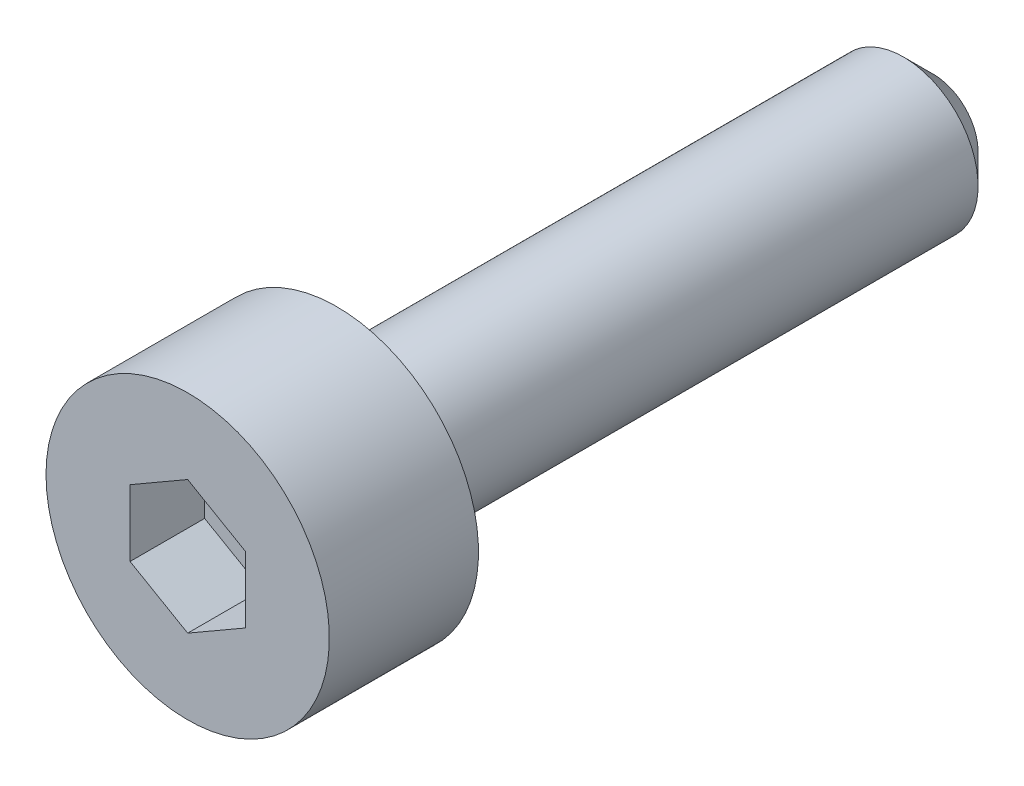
ISO-10303-21;
HEADER;
FILE_DESCRIPTION(('STEP AP214'),'2;1');
FILE_NAME('part.step','',(''),(''),'','','');
FILE_SCHEMA(('AUTOMOTIVE_DESIGN { 1 0 10303 214 1 1 1 1 }'));
ENDSEC;
DATA;
#1=APPLICATION_CONTEXT('core data for automotive mechanical design processes');
#2=APPLICATION_PROTOCOL_DEFINITION('international standard','automotive_design',2000,#1);
#3=PRODUCT_CONTEXT('',#1,'mechanical');
#4=PRODUCT('Part','Part','',(#3));
#5=PRODUCT_RELATED_PRODUCT_CATEGORY('part','',(#4));
#6=PRODUCT_DEFINITION_FORMATION('','',#4);
#7=PRODUCT_DEFINITION_CONTEXT('part definition',#1,'design');
#8=PRODUCT_DEFINITION('design','',#6,#7);
#9=PRODUCT_DEFINITION_SHAPE('','',#8);
#10=(LENGTH_UNIT() NAMED_UNIT(*) SI_UNIT(.MILLI.,.METRE.));
#11=(NAMED_UNIT(*) PLANE_ANGLE_UNIT() SI_UNIT($,.RADIAN.));
#12=(NAMED_UNIT(*) SI_UNIT($,.STERADIAN.) SOLID_ANGLE_UNIT());
#13=UNCERTAINTY_MEASURE_WITH_UNIT(LENGTH_MEASURE(1.E-05),#10,'distance_accuracy_value','');
#14=(GEOMETRIC_REPRESENTATION_CONTEXT(3) GLOBAL_UNCERTAINTY_ASSIGNED_CONTEXT((#13)) GLOBAL_UNIT_ASSIGNED_CONTEXT((#10,
#11,#12)) REPRESENTATION_CONTEXT('',''));
#15=CARTESIAN_POINT('',(0.,0.,0.));
#16=DIRECTION('',(0.,0.,1.));
#17=DIRECTION('',(1.,0.,0.));
#18=AXIS2_PLACEMENT_3D('',#15,#16,#17);
#19=CARTESIAN_POINT('',(0.,0.,0.));
#20=DIRECTION('',(0.,0.,-1.));
#21=DIRECTION('',(-1.,0.,0.));
#22=AXIS2_PLACEMENT_3D('',#19,#20,#21);
#23=PLANE('',#22);
#24=CARTESIAN_POINT('',(0.,0.,0.));
#25=DIRECTION('',(0.,0.,-1.));
#26=DIRECTION('',(-1.,0.,0.));
#27=AXIS2_PLACEMENT_3D('',#24,#25,#26);
#28=CIRCLE('',#27,1.9);
#29=CARTESIAN_POINT('',(-1.9,0.,0.));
#30=VERTEX_POINT('',#29);
#31=EDGE_CURVE('E124',#30,#30,#28,.T.);
#32=ORIENTED_EDGE('',*,*,#31,.T.);
#33=EDGE_LOOP('',(#32));
#34=FACE_BOUND('',#33,.T.);
#35=CARTESIAN_POINT('',(0.,0.,0.));
#36=DIRECTION('',(0.,0.,-1.));
#37=DIRECTION('',(-1.,0.,0.));
#38=AXIS2_PLACEMENT_3D('',#35,#36,#37);
#39=CIRCLE('',#38,1.);
#40=CARTESIAN_POINT('',(-1.,0.,0.));
#41=VERTEX_POINT('',#40);
#42=EDGE_CURVE('E116',#41,#41,#39,.T.);
#43=ORIENTED_EDGE('',*,*,#42,.F.);
#44=EDGE_LOOP('',(#43));
#45=FACE_BOUND('',#44,.T.);
#46=ADVANCED_FACE('F14',(#34,#45),#23,.T.);
#47=CARTESIAN_POINT('',(0.,0.,2.));
#48=DIRECTION('',(0.,0.,-1.));
#49=DIRECTION('',(-1.,0.,0.));
#50=AXIS2_PLACEMENT_3D('',#47,#48,#49);
#51=CYLINDRICAL_SURFACE('',#50,1.9);
#52=CARTESIAN_POINT('',(0.,0.,2.));
#53=DIRECTION('',(0.,0.,-1.));
#54=DIRECTION('',(-1.,0.,0.));
#55=AXIS2_PLACEMENT_3D('',#52,#53,#54);
#56=CIRCLE('',#55,1.9);
#57=CARTESIAN_POINT('',(-1.9,0.,2.));
#58=VERTEX_POINT('',#57);
#59=EDGE_CURVE('E125',#58,#58,#56,.T.);
#60=ORIENTED_EDGE('',*,*,#59,.T.);
#61=EDGE_LOOP('',(#60));
#62=FACE_BOUND('',#61,.T.);
#63=ORIENTED_EDGE('',*,*,#31,.F.);
#64=EDGE_LOOP('',(#63));
#65=FACE_BOUND('',#64,.T.);
#66=ADVANCED_FACE('F149',(#62,#65),#51,.T.);
#67=CARTESIAN_POINT('',(0.,0.,2.));
#68=DIRECTION('',(0.,0.,-1.));
#69=DIRECTION('',(-1.,0.,0.));
#70=AXIS2_PLACEMENT_3D('',#67,#68,#69);
#71=PLANE('',#70);
#72=DIRECTION('',(-0.866025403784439,-0.5,0.));
#73=VECTOR('',#72,1.);
#74=CARTESIAN_POINT('',(0.,0.892006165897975,2.));
#75=LINE('',#74,#73);
#76=CARTESIAN_POINT('',(0.,0.892006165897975,2.));
#77=VERTEX_POINT('',#76);
#78=CARTESIAN_POINT('',(-0.7725,0.44600308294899,2.));
#79=VERTEX_POINT('',#78);
#80=EDGE_CURVE('E103',#77,#79,#75,.T.);
#81=ORIENTED_EDGE('',*,*,#80,.F.);
#82=DIRECTION('',(-0.86602540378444,0.5,0.));
#83=VECTOR('',#82,1.);
#84=CARTESIAN_POINT('',(0.7725,0.446003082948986,2.));
#85=LINE('',#84,#83);
#86=CARTESIAN_POINT('',(0.7725,0.446003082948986,2.));
#87=VERTEX_POINT('',#86);
#88=EDGE_CURVE('E29',#87,#77,#85,.T.);
#89=ORIENTED_EDGE('',*,*,#88,.F.);
#90=DIRECTION('',(0.,1.,0.));
#91=VECTOR('',#90,1.);
#92=CARTESIAN_POINT('',(0.7725,-0.44600308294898,2.));
#93=LINE('',#92,#91);
#94=CARTESIAN_POINT('',(0.7725,-0.44600308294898,2.));
#95=VERTEX_POINT('',#94);
#96=EDGE_CURVE('E112',#95,#87,#93,.T.);
#97=ORIENTED_EDGE('',*,*,#96,.F.);
#98=DIRECTION('',(0.86602540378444,0.5,0.));
#99=VECTOR('',#98,1.);
#100=CARTESIAN_POINT('',(0.,-0.892006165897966,2.));
#101=LINE('',#100,#99);
#102=CARTESIAN_POINT('',(0.,-0.892006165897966,2.));
#103=VERTEX_POINT('',#102);
#104=EDGE_CURVE('E110',#103,#95,#101,.T.);
#105=ORIENTED_EDGE('',*,*,#104,.F.);
#106=DIRECTION('',(0.866025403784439,-0.5,0.));
#107=VECTOR('',#106,1.);
#108=CARTESIAN_POINT('',(-0.7725,-0.446003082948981,2.));
#109=LINE('',#108,#107);
#110=CARTESIAN_POINT('',(-0.7725,-0.446003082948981,2.));
#111=VERTEX_POINT('',#110);
#112=EDGE_CURVE('E77',#111,#103,#109,.T.);
#113=ORIENTED_EDGE('',*,*,#112,.F.);
#114=DIRECTION('',(0.,-1.,0.));
#115=VECTOR('',#114,1.);
#116=CARTESIAN_POINT('',(-0.7725,0.44600308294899,2.));
#117=LINE('',#116,#115);
#118=EDGE_CURVE('E106',#79,#111,#117,.T.);
#119=ORIENTED_EDGE('',*,*,#118,.F.);
#120=EDGE_LOOP('',(#81,#89,#97,#105,#113,#119));
#121=FACE_BOUND('',#120,.T.);
#122=ORIENTED_EDGE('',*,*,#59,.F.);
#123=EDGE_LOOP('',(#122));
#124=FACE_BOUND('',#123,.T.);
#125=ADVANCED_FACE('F156',(#121,#124),#71,.F.);
#126=CARTESIAN_POINT('',(0.,0.,-8.));
#127=DIRECTION('',(0.,0.,1.));
#128=DIRECTION('',(1.,0.,0.));
#129=AXIS2_PLACEMENT_3D('',#126,#127,#128);
#130=CYLINDRICAL_SURFACE('',#129,1.);
#131=CARTESIAN_POINT('',(0.,0.,-7.6));
#132=DIRECTION('',(0.,0.,-1.));
#133=DIRECTION('',(-1.,0.,0.));
#134=AXIS2_PLACEMENT_3D('',#131,#132,#133);
#135=CIRCLE('',#134,1.);
#136=CARTESIAN_POINT('',(-1.,0.,-7.6));
#137=VERTEX_POINT('',#136);
#138=EDGE_CURVE('E9',#137,#137,#135,.F.);
#139=ORIENTED_EDGE('',*,*,#138,.T.);
#140=EDGE_LOOP('',(#139));
#141=FACE_BOUND('',#140,.T.);
#142=ORIENTED_EDGE('',*,*,#42,.T.);
#143=EDGE_LOOP('',(#142));
#144=FACE_BOUND('',#143,.T.);
#145=ADVANCED_FACE('F145',(#141,#144),#130,.T.);
#146=CARTESIAN_POINT('',(0.,0.,-8.));
#147=DIRECTION('',(0.,0.,-1.));
#148=DIRECTION('',(-1.,0.,0.));
#149=AXIS2_PLACEMENT_3D('',#146,#147,#148);
#150=PLANE('',#149);
#151=CARTESIAN_POINT('',(0.,0.,-8.));
#152=DIRECTION('',(0.,0.,-1.));
#153=DIRECTION('',(-1.,0.,0.));
#154=AXIS2_PLACEMENT_3D('',#151,#152,#153);
#155=CIRCLE('',#154,0.6);
#156=CARTESIAN_POINT('',(-0.600000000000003,0.,-8.));
#157=VERTEX_POINT('',#156);
#158=EDGE_CURVE('E22',#157,#157,#155,.T.);
#159=ORIENTED_EDGE('',*,*,#158,.T.);
#160=EDGE_LOOP('',(#159));
#161=FACE_BOUND('',#160,.T.);
#162=ADVANCED_FACE('F132',(#161),#150,.T.);
#163=CARTESIAN_POINT('',(0.,0.,-8.));
#164=DIRECTION('',(0.,0.,1.));
#165=DIRECTION('',(1.,0.,0.));
#166=AXIS2_PLACEMENT_3D('',#163,#164,#165);
#167=CONICAL_SURFACE('',#166,0.6,0.785398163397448);
#168=ORIENTED_EDGE('',*,*,#138,.F.);
#169=EDGE_LOOP('',(#168));
#170=FACE_BOUND('',#169,.T.);
#171=ORIENTED_EDGE('',*,*,#158,.F.);
#172=EDGE_LOOP('',(#171));
#173=FACE_BOUND('',#172,.T.);
#174=ADVANCED_FACE('F16',(#170,#173),#167,.T.);
#175=CARTESIAN_POINT('',(0.7725,0.446003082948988,1.));
#176=DIRECTION('',(0.5,0.86602540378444,0.));
#177=DIRECTION('',(0.86602540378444,-0.5,0.));
#178=AXIS2_PLACEMENT_3D('',#175,#176,#177);
#179=PLANE('',#178);
#180=ORIENTED_EDGE('',*,*,#88,.T.);
#181=DIRECTION('',(0.,0.,1.));
#182=VECTOR('',#181,1.);
#183=CARTESIAN_POINT('',(0.,0.892006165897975,1.));
#184=LINE('',#183,#182);
#185=CARTESIAN_POINT('',(0.,0.892006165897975,1.));
#186=VERTEX_POINT('',#185);
#187=EDGE_CURVE('E59',#186,#77,#184,.T.);
#188=ORIENTED_EDGE('',*,*,#187,.F.);
#189=DIRECTION('',(-0.86602540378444,0.5,0.));
#190=VECTOR('',#189,1.);
#191=CARTESIAN_POINT('',(0.7725,0.446003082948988,1.));
#192=LINE('',#191,#190);
#193=CARTESIAN_POINT('',(0.7725,0.446003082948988,1.));
#194=VERTEX_POINT('',#193);
#195=EDGE_CURVE('E114',#194,#186,#192,.T.);
#196=ORIENTED_EDGE('',*,*,#195,.F.);
#197=DIRECTION('',(0.,0.,1.));
#198=VECTOR('',#197,1.);
#199=CARTESIAN_POINT('',(0.7725,0.446003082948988,1.));
#200=LINE('',#199,#198);
#201=EDGE_CURVE('E37',#194,#87,#200,.T.);
#202=ORIENTED_EDGE('',*,*,#201,.T.);
#203=EDGE_LOOP('',(#180,#188,#196,#202));
#204=FACE_BOUND('',#203,.T.);
#205=ADVANCED_FACE('F135',(#204),#179,.F.);
#206=CARTESIAN_POINT('',(0.7725,-0.44600308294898,1.));
#207=DIRECTION('',(1.,0.,0.));
#208=DIRECTION('',(0.,-1.,0.));
#209=AXIS2_PLACEMENT_3D('',#206,#207,#208);
#210=PLANE('',#209);
#211=ORIENTED_EDGE('',*,*,#96,.T.);
#212=ORIENTED_EDGE('',*,*,#201,.F.);
#213=DIRECTION('',(0.,1.,0.));
#214=VECTOR('',#213,1.);
#215=CARTESIAN_POINT('',(0.7725,-0.44600308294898,1.));
#216=LINE('',#215,#214);
#217=CARTESIAN_POINT('',(0.7725,-0.44600308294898,1.));
#218=VERTEX_POINT('',#217);
#219=EDGE_CURVE('E89',#218,#194,#216,.T.);
#220=ORIENTED_EDGE('',*,*,#219,.F.);
#221=DIRECTION('',(0.,0.,1.));
#222=VECTOR('',#221,1.);
#223=CARTESIAN_POINT('',(0.7725,-0.44600308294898,1.));
#224=LINE('',#223,#222);
#225=EDGE_CURVE('E81',#218,#95,#224,.T.);
#226=ORIENTED_EDGE('',*,*,#225,.T.);
#227=EDGE_LOOP('',(#211,#212,#220,#226));
#228=FACE_BOUND('',#227,.T.);
#229=ADVANCED_FACE('F143',(#228),#210,.F.);
#230=CARTESIAN_POINT('',(0.,-0.892006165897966,1.));
#231=DIRECTION('',(0.5,-0.86602540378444,0.));
#232=DIRECTION('',(-0.86602540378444,-0.5,0.));
#233=AXIS2_PLACEMENT_3D('',#230,#231,#232);
#234=PLANE('',#233);
#235=ORIENTED_EDGE('',*,*,#104,.T.);
#236=ORIENTED_EDGE('',*,*,#225,.F.);
#237=DIRECTION('',(0.86602540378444,0.5,0.));
#238=VECTOR('',#237,1.);
#239=CARTESIAN_POINT('',(0.,-0.892006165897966,1.));
#240=LINE('',#239,#238);
#241=CARTESIAN_POINT('',(0.,-0.892006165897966,1.));
#242=VERTEX_POINT('',#241);
#243=EDGE_CURVE('E85',#242,#218,#240,.T.);
#244=ORIENTED_EDGE('',*,*,#243,.F.);
#245=DIRECTION('',(0.,0.,1.));
#246=VECTOR('',#245,1.);
#247=CARTESIAN_POINT('',(0.,-0.892006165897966,1.));
#248=LINE('',#247,#246);
#249=EDGE_CURVE('E70',#242,#103,#248,.T.);
#250=ORIENTED_EDGE('',*,*,#249,.T.);
#251=EDGE_LOOP('',(#235,#236,#244,#250));
#252=FACE_BOUND('',#251,.T.);
#253=ADVANCED_FACE('F86',(#252),#234,.F.);
#254=CARTESIAN_POINT('',(-0.7725,-0.44600308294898,1.));
#255=DIRECTION('',(-0.5,-0.866025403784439,0.));
#256=DIRECTION('',(-0.866025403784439,0.5,0.));
#257=AXIS2_PLACEMENT_3D('',#254,#255,#256);
#258=PLANE('',#257);
#259=ORIENTED_EDGE('',*,*,#112,.T.);
#260=ORIENTED_EDGE('',*,*,#249,.F.);
#261=DIRECTION('',(0.866025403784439,-0.5,0.));
#262=VECTOR('',#261,1.);
#263=CARTESIAN_POINT('',(-0.7725,-0.44600308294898,1.));
#264=LINE('',#263,#262);
#265=CARTESIAN_POINT('',(-0.7725,-0.44600308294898,1.));
#266=VERTEX_POINT('',#265);
#267=EDGE_CURVE('E74',#266,#242,#264,.T.);
#268=ORIENTED_EDGE('',*,*,#267,.F.);
#269=DIRECTION('',(0.,0.,1.));
#270=VECTOR('',#269,1.);
#271=CARTESIAN_POINT('',(-0.7725,-0.44600308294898,1.));
#272=LINE('',#271,#270);
#273=EDGE_CURVE('E82',#266,#111,#272,.T.);
#274=ORIENTED_EDGE('',*,*,#273,.T.);
#275=EDGE_LOOP('',(#259,#260,#268,#274));
#276=FACE_BOUND('',#275,.T.);
#277=ADVANCED_FACE('F72',(#276),#258,.F.);
#278=CARTESIAN_POINT('',(-0.7725,0.44600308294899,1.));
#279=DIRECTION('',(-1.,0.,0.));
#280=DIRECTION('',(0.,1.,0.));
#281=AXIS2_PLACEMENT_3D('',#278,#279,#280);
#282=PLANE('',#281);
#283=ORIENTED_EDGE('',*,*,#118,.T.);
#284=ORIENTED_EDGE('',*,*,#273,.F.);
#285=DIRECTION('',(0.,-1.,0.));
#286=VECTOR('',#285,1.);
#287=CARTESIAN_POINT('',(-0.7725,0.44600308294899,1.));
#288=LINE('',#287,#286);
#289=CARTESIAN_POINT('',(-0.7725,0.44600308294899,1.));
#290=VERTEX_POINT('',#289);
#291=EDGE_CURVE('E95',#290,#266,#288,.T.);
#292=ORIENTED_EDGE('',*,*,#291,.F.);
#293=DIRECTION('',(0.,0.,1.));
#294=VECTOR('',#293,1.);
#295=CARTESIAN_POINT('',(-0.7725,0.44600308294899,1.));
#296=LINE('',#295,#294);
#297=EDGE_CURVE('E119',#290,#79,#296,.T.);
#298=ORIENTED_EDGE('',*,*,#297,.T.);
#299=EDGE_LOOP('',(#283,#284,#292,#298));
#300=FACE_BOUND('',#299,.T.);
#301=ADVANCED_FACE('F169',(#300),#282,.F.);
#302=CARTESIAN_POINT('',(0.,0.892006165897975,1.));
#303=DIRECTION('',(-0.5,0.866025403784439,0.));
#304=DIRECTION('',(0.866025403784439,0.5,0.));
#305=AXIS2_PLACEMENT_3D('',#302,#303,#304);
#306=PLANE('',#305);
#307=ORIENTED_EDGE('',*,*,#80,.T.);
#308=ORIENTED_EDGE('',*,*,#297,.F.);
#309=DIRECTION('',(-0.866025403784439,-0.5,0.));
#310=VECTOR('',#309,1.);
#311=CARTESIAN_POINT('',(0.,0.892006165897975,1.));
#312=LINE('',#311,#310);
#313=EDGE_CURVE('E97',#186,#290,#312,.T.);
#314=ORIENTED_EDGE('',*,*,#313,.F.);
#315=ORIENTED_EDGE('',*,*,#187,.T.);
#316=EDGE_LOOP('',(#307,#308,#314,#315));
#317=FACE_BOUND('',#316,.T.);
#318=ADVANCED_FACE('F166',(#317),#306,.F.);
#319=CARTESIAN_POINT('',(0.,0.892006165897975,1.));
#320=DIRECTION('',(0.,0.,1.));
#321=DIRECTION('',(1.,0.,0.));
#322=AXIS2_PLACEMENT_3D('',#319,#320,#321);
#323=PLANE('',#322);
#324=ORIENTED_EDGE('',*,*,#195,.T.);
#325=ORIENTED_EDGE('',*,*,#313,.T.);
#326=ORIENTED_EDGE('',*,*,#291,.T.);
#327=ORIENTED_EDGE('',*,*,#267,.T.);
#328=ORIENTED_EDGE('',*,*,#243,.T.);
#329=ORIENTED_EDGE('',*,*,#219,.T.);
#330=EDGE_LOOP('',(#324,#325,#326,#327,#328,#329));
#331=FACE_BOUND('',#330,.T.);
#332=ADVANCED_FACE('F92',(#331),#323,.T.);
#333=CLOSED_SHELL('',(#46,#66,#125,#145,#162,#174,#205,#229,#253,#277,#301,#318,#332));
#334=MANIFOLD_SOLID_BREP('B1',#333);
#335=ADVANCED_BREP_SHAPE_REPRESENTATION('',(#18,#334),#14);
#336=SHAPE_DEFINITION_REPRESENTATION(#9,#335);
ENDSEC;
END-ISO-10303-21;
